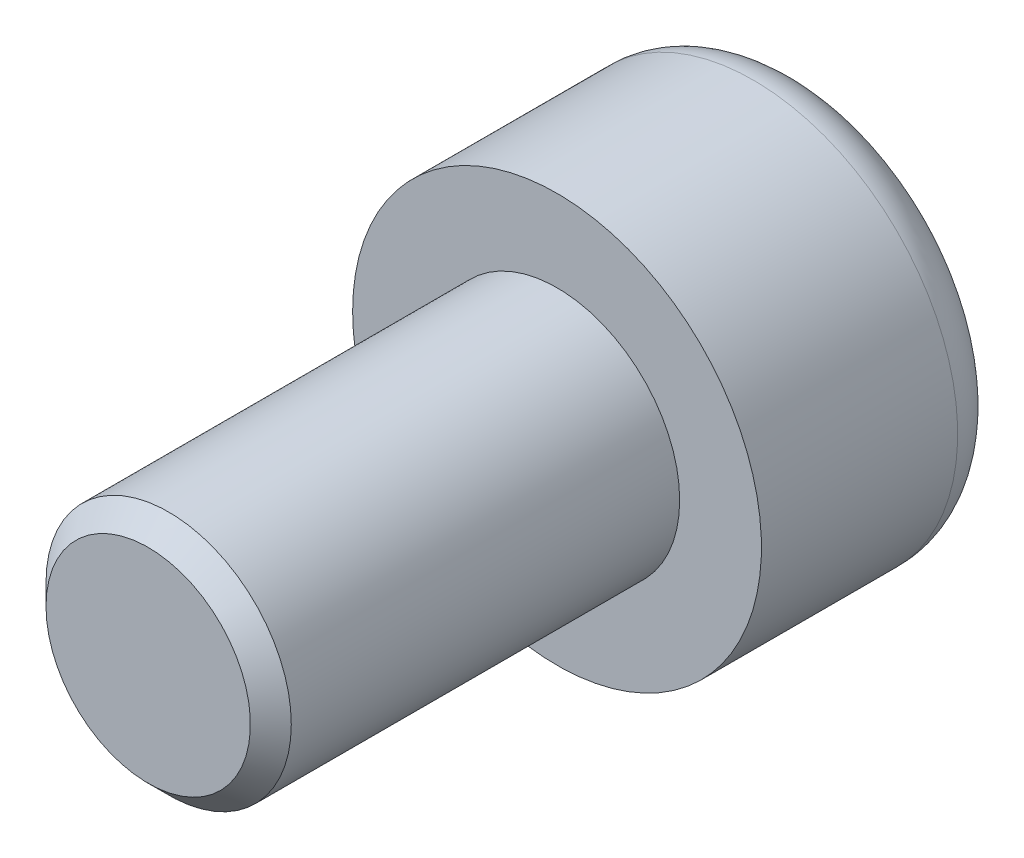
ISO-10303-21;
HEADER;
FILE_DESCRIPTION(('STEP AP214'),'2;1');
FILE_NAME('part.step','',(''),(''),'','','');
FILE_SCHEMA(('AUTOMOTIVE_DESIGN { 1 0 10303 214 1 1 1 1 }'));
ENDSEC;
DATA;
#1=APPLICATION_CONTEXT('core data for automotive mechanical design processes');
#2=APPLICATION_PROTOCOL_DEFINITION('international standard','automotive_design',2000,#1);
#3=PRODUCT_CONTEXT('',#1,'mechanical');
#4=PRODUCT('Part','Part','',(#3));
#5=PRODUCT_RELATED_PRODUCT_CATEGORY('part','',(#4));
#6=PRODUCT_DEFINITION_FORMATION('','',#4);
#7=PRODUCT_DEFINITION_CONTEXT('part definition',#1,'design');
#8=PRODUCT_DEFINITION('design','',#6,#7);
#9=PRODUCT_DEFINITION_SHAPE('','',#8);
#10=(LENGTH_UNIT() NAMED_UNIT(*) SI_UNIT(.MILLI.,.METRE.));
#11=(NAMED_UNIT(*) PLANE_ANGLE_UNIT() SI_UNIT($,.RADIAN.));
#12=(NAMED_UNIT(*) SI_UNIT($,.STERADIAN.) SOLID_ANGLE_UNIT());
#13=UNCERTAINTY_MEASURE_WITH_UNIT(LENGTH_MEASURE(1.E-05),#10,'distance_accuracy_value','');
#14=(GEOMETRIC_REPRESENTATION_CONTEXT(3) GLOBAL_UNCERTAINTY_ASSIGNED_CONTEXT((#13)) GLOBAL_UNIT_ASSIGNED_CONTEXT((#10,
#11,#12)) REPRESENTATION_CONTEXT('',''));
#15=CARTESIAN_POINT('',(0.,0.,0.));
#16=DIRECTION('',(0.,0.,1.));
#17=DIRECTION('',(1.,0.,0.));
#18=AXIS2_PLACEMENT_3D('',#15,#16,#17);
#19=CARTESIAN_POINT('',(-4.99999999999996,0.,3.75));
#20=DIRECTION('',(0.,0.,1.));
#21=DIRECTION('',(1.,0.,0.));
#22=AXIS2_PLACEMENT_3D('',#19,#20,#21);
#23=PLANE('',#22);
#24=DIRECTION('',(-0.866025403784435,0.500000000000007,0.));
#25=VECTOR('',#24,1.);
#26=CARTESIAN_POINT('',(0.,2.88675134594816,3.75));
#27=LINE('',#26,#25);
#28=CARTESIAN_POINT('',(0.,2.88675134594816,3.75));
#29=VERTEX_POINT('',#28);
#30=CARTESIAN_POINT('',(2.5,1.44337567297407,3.75));
#31=VERTEX_POINT('',#30);
#32=EDGE_CURVE('E64',#29,#31,#27,.F.);
#33=ORIENTED_EDGE('',*,*,#32,.T.);
#34=DIRECTION('',(0.,1.,0.));
#35=VECTOR('',#34,1.);
#36=CARTESIAN_POINT('',(2.5,1.44337567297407,3.75));
#37=LINE('',#36,#35);
#38=CARTESIAN_POINT('',(2.5,-1.44337567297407,3.75));
#39=VERTEX_POINT('',#38);
#40=EDGE_CURVE('E61',#31,#39,#37,.F.);
#41=ORIENTED_EDGE('',*,*,#40,.T.);
#42=DIRECTION('',(0.866025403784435,0.500000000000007,0.));
#43=VECTOR('',#42,1.);
#44=CARTESIAN_POINT('',(2.5,-1.44337567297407,3.75));
#45=LINE('',#44,#43);
#46=CARTESIAN_POINT('',(0.,-2.88675134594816,3.75));
#47=VERTEX_POINT('',#46);
#48=EDGE_CURVE('E58',#39,#47,#45,.F.);
#49=ORIENTED_EDGE('',*,*,#48,.T.);
#50=DIRECTION('',(0.866025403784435,-0.500000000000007,0.));
#51=VECTOR('',#50,1.);
#52=CARTESIAN_POINT('',(-2.5,-1.44337567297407,3.75));
#53=LINE('',#52,#51);
#54=CARTESIAN_POINT('',(-2.5,-1.44337567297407,3.75));
#55=VERTEX_POINT('',#54);
#56=EDGE_CURVE('E85',#47,#55,#53,.F.);
#57=ORIENTED_EDGE('',*,*,#56,.T.);
#58=DIRECTION('',(0.,1.,0.));
#59=VECTOR('',#58,1.);
#60=CARTESIAN_POINT('',(-2.5,1.44337567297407,3.75));
#61=LINE('',#60,#59);
#62=CARTESIAN_POINT('',(-2.5,1.44337567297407,3.75));
#63=VERTEX_POINT('',#62);
#64=EDGE_CURVE('E283',#55,#63,#61,.T.);
#65=ORIENTED_EDGE('',*,*,#64,.T.);
#66=DIRECTION('',(-0.866025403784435,-0.500000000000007,0.));
#67=VECTOR('',#66,1.);
#68=CARTESIAN_POINT('',(0.,2.88675134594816,3.75));
#69=LINE('',#68,#67);
#70=EDGE_CURVE('E290',#63,#29,#69,.F.);
#71=ORIENTED_EDGE('',*,*,#70,.T.);
#72=EDGE_LOOP('',(#33,#41,#49,#57,#65,#71));
#73=FACE_BOUND('',#72,.T.);
#74=ADVANCED_FACE('F15',(#73),#23,.F.);
#75=CARTESIAN_POINT('',(2.5,1.44337567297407,3.75));
#76=DIRECTION('',(1.,0.,0.));
#77=DIRECTION('',(0.,0.,-1.));
#78=AXIS2_PLACEMENT_3D('',#75,#76,#77);
#79=PLANE('',#78);
#80=DIRECTION('',(0.,0.,1.));
#81=VECTOR('',#80,1.);
#82=CARTESIAN_POINT('',(2.5,-1.44337567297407,3.75));
#83=LINE('',#82,#81);
#84=CARTESIAN_POINT('',(2.5,-1.44337567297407,0.));
#85=VERTEX_POINT('',#84);
#86=EDGE_CURVE('E68',#85,#39,#83,.T.);
#87=ORIENTED_EDGE('',*,*,#86,.T.);
#88=ORIENTED_EDGE('',*,*,#40,.F.);
#89=DIRECTION('',(0.,0.,1.));
#90=VECTOR('',#89,1.);
#91=CARTESIAN_POINT('',(2.5,1.44337567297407,3.75));
#92=LINE('',#91,#90);
#93=CARTESIAN_POINT('',(2.5,1.44337567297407,0.));
#94=VERTEX_POINT('',#93);
#95=EDGE_CURVE('E121',#31,#94,#92,.F.);
#96=ORIENTED_EDGE('',*,*,#95,.T.);
#97=DIRECTION('',(0.,1.,0.));
#98=VECTOR('',#97,1.);
#99=CARTESIAN_POINT('',(2.5,0.,0.));
#100=LINE('',#99,#98);
#101=EDGE_CURVE('E75',#94,#85,#100,.F.);
#102=ORIENTED_EDGE('',*,*,#101,.T.);
#103=EDGE_LOOP('',(#87,#88,#96,#102));
#104=FACE_BOUND('',#103,.T.);
#105=ADVANCED_FACE('F72',(#104),#79,.F.);
#106=CARTESIAN_POINT('',(2.5,-1.44337567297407,3.75));
#107=DIRECTION('',(0.500000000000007,-0.866025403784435,0.));
#108=DIRECTION('',(0.866025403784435,0.500000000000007,0.));
#109=AXIS2_PLACEMENT_3D('',#106,#107,#108);
#110=PLANE('',#109);
#111=DIRECTION('',(0.,0.,1.));
#112=VECTOR('',#111,1.);
#113=CARTESIAN_POINT('',(0.,-2.88675134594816,3.75));
#114=LINE('',#113,#112);
#115=CARTESIAN_POINT('',(0.,-2.88675134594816,0.));
#116=VERTEX_POINT('',#115);
#117=EDGE_CURVE('E82',#116,#47,#114,.T.);
#118=ORIENTED_EDGE('',*,*,#117,.T.);
#119=ORIENTED_EDGE('',*,*,#48,.F.);
#120=ORIENTED_EDGE('',*,*,#86,.F.);
#121=DIRECTION('',(-0.866025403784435,-0.500000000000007,0.));
#122=VECTOR('',#121,1.);
#123=CARTESIAN_POINT('',(2.5,-1.44337567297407,0.));
#124=LINE('',#123,#122);
#125=EDGE_CURVE('E119',#85,#116,#124,.T.);
#126=ORIENTED_EDGE('',*,*,#125,.T.);
#127=EDGE_LOOP('',(#118,#119,#120,#126));
#128=FACE_BOUND('',#127,.T.);
#129=ADVANCED_FACE('F80',(#128),#110,.F.);
#130=CARTESIAN_POINT('',(-2.5,-1.44337567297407,3.75));
#131=DIRECTION('',(-0.500000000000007,-0.866025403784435,0.));
#132=DIRECTION('',(0.866025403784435,-0.500000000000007,0.));
#133=AXIS2_PLACEMENT_3D('',#130,#131,#132);
#134=PLANE('',#133);
#135=DIRECTION('',(0.,0.,1.));
#136=VECTOR('',#135,1.);
#137=CARTESIAN_POINT('',(-2.5,-1.44337567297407,3.75));
#138=LINE('',#137,#136);
#139=CARTESIAN_POINT('',(-2.5,-1.44337567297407,0.));
#140=VERTEX_POINT('',#139);
#141=EDGE_CURVE('E278',#140,#55,#138,.T.);
#142=ORIENTED_EDGE('',*,*,#141,.T.);
#143=ORIENTED_EDGE('',*,*,#56,.F.);
#144=ORIENTED_EDGE('',*,*,#117,.F.);
#145=DIRECTION('',(-0.866025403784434,0.500000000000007,0.));
#146=VECTOR('',#145,1.);
#147=CARTESIAN_POINT('',(0.,-2.88675134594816,0.));
#148=LINE('',#147,#146);
#149=EDGE_CURVE('E116',#116,#140,#148,.T.);
#150=ORIENTED_EDGE('',*,*,#149,.T.);
#151=EDGE_LOOP('',(#142,#143,#144,#150));
#152=FACE_BOUND('',#151,.T.);
#153=ADVANCED_FACE('F233',(#152),#134,.F.);
#154=CARTESIAN_POINT('',(-2.5,1.44337567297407,3.75));
#155=DIRECTION('',(-1.,0.,0.));
#156=DIRECTION('',(0.,0.,1.));
#157=AXIS2_PLACEMENT_3D('',#154,#155,#156);
#158=PLANE('',#157);
#159=DIRECTION('',(0.,0.,1.));
#160=VECTOR('',#159,1.);
#161=CARTESIAN_POINT('',(-2.5,1.44337567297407,3.75));
#162=LINE('',#161,#160);
#163=CARTESIAN_POINT('',(-2.5,1.44337567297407,0.));
#164=VERTEX_POINT('',#163);
#165=EDGE_CURVE('E287',#164,#63,#162,.T.);
#166=ORIENTED_EDGE('',*,*,#165,.T.);
#167=ORIENTED_EDGE('',*,*,#64,.F.);
#168=ORIENTED_EDGE('',*,*,#141,.F.);
#169=DIRECTION('',(0.,1.,0.));
#170=VECTOR('',#169,1.);
#171=CARTESIAN_POINT('',(-2.5,0.,0.));
#172=LINE('',#171,#170);
#173=EDGE_CURVE('E107',#140,#164,#172,.T.);
#174=ORIENTED_EDGE('',*,*,#173,.T.);
#175=EDGE_LOOP('',(#166,#167,#168,#174));
#176=FACE_BOUND('',#175,.T.);
#177=ADVANCED_FACE('F223',(#176),#158,.F.);
#178=CARTESIAN_POINT('',(0.,2.88675134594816,3.75));
#179=DIRECTION('',(-0.500000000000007,0.866025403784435,0.));
#180=DIRECTION('',(-0.866025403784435,-0.500000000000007,0.));
#181=AXIS2_PLACEMENT_3D('',#178,#179,#180);
#182=PLANE('',#181);
#183=DIRECTION('',(0.,0.,1.));
#184=VECTOR('',#183,1.);
#185=CARTESIAN_POINT('',(0.,2.88675134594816,3.75));
#186=LINE('',#185,#184);
#187=CARTESIAN_POINT('',(0.,2.88675134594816,0.));
#188=VERTEX_POINT('',#187);
#189=EDGE_CURVE('E294',#188,#29,#186,.T.);
#190=ORIENTED_EDGE('',*,*,#189,.T.);
#191=ORIENTED_EDGE('',*,*,#70,.F.);
#192=ORIENTED_EDGE('',*,*,#165,.F.);
#193=DIRECTION('',(0.866025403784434,0.500000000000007,0.));
#194=VECTOR('',#193,1.);
#195=CARTESIAN_POINT('',(-2.5,1.44337567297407,0.));
#196=LINE('',#195,#194);
#197=EDGE_CURVE('E101',#164,#188,#196,.T.);
#198=ORIENTED_EDGE('',*,*,#197,.T.);
#199=EDGE_LOOP('',(#190,#191,#192,#198));
#200=FACE_BOUND('',#199,.T.);
#201=ADVANCED_FACE('F162',(#200),#182,.F.);
#202=CARTESIAN_POINT('',(0.,2.88675134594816,3.75));
#203=DIRECTION('',(0.500000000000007,0.866025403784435,0.));
#204=DIRECTION('',(-0.866025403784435,0.500000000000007,0.));
#205=AXIS2_PLACEMENT_3D('',#202,#203,#204);
#206=PLANE('',#205);
#207=ORIENTED_EDGE('',*,*,#95,.F.);
#208=ORIENTED_EDGE('',*,*,#32,.F.);
#209=ORIENTED_EDGE('',*,*,#189,.F.);
#210=DIRECTION('',(0.866025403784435,-0.500000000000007,0.));
#211=VECTOR('',#210,1.);
#212=CARTESIAN_POINT('',(0.,2.88675134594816,0.));
#213=LINE('',#212,#211);
#214=EDGE_CURVE('E99',#188,#94,#213,.T.);
#215=ORIENTED_EDGE('',*,*,#214,.T.);
#216=EDGE_LOOP('',(#207,#208,#209,#215));
#217=FACE_BOUND('',#216,.T.);
#218=ADVANCED_FACE('F156',(#217),#206,.F.);
#219=CARTESIAN_POINT('',(0.,0.,0.));
#220=DIRECTION('',(0.,0.,1.));
#221=DIRECTION('',(1.,0.,0.));
#222=AXIS2_PLACEMENT_3D('',#219,#220,#221);
#223=PLANE('',#222);
#224=ORIENTED_EDGE('',*,*,#197,.F.);
#225=ORIENTED_EDGE('',*,*,#173,.F.);
#226=ORIENTED_EDGE('',*,*,#149,.F.);
#227=ORIENTED_EDGE('',*,*,#125,.F.);
#228=ORIENTED_EDGE('',*,*,#101,.F.);
#229=ORIENTED_EDGE('',*,*,#214,.F.);
#230=EDGE_LOOP('',(#224,#225,#226,#227,#228,#229));
#231=FACE_BOUND('',#230,.T.);
#232=CARTESIAN_POINT('',(0.,0.,0.));
#233=DIRECTION('',(0.,0.,1.));
#234=DIRECTION('',(1.,0.,0.));
#235=AXIS2_PLACEMENT_3D('',#232,#233,#234);
#236=CIRCLE('',#235,3.8);
#237=CARTESIAN_POINT('',(3.8,0.,0.));
#238=VERTEX_POINT('',#237);
#239=CARTESIAN_POINT('',(-3.8,0.,0.));
#240=VERTEX_POINT('',#239);
#241=EDGE_CURVE('E97',#238,#240,#236,.T.);
#242=ORIENTED_EDGE('',*,*,#241,.F.);
#243=CARTESIAN_POINT('',(0.,0.,0.));
#244=DIRECTION('',(0.,0.,1.));
#245=DIRECTION('',(-1.,0.,0.));
#246=AXIS2_PLACEMENT_3D('',#243,#244,#245);
#247=CIRCLE('',#246,3.8);
#248=EDGE_CURVE('E34',#240,#238,#247,.T.);
#249=ORIENTED_EDGE('',*,*,#248,.F.);
#250=EDGE_LOOP('',(#242,#249));
#251=FACE_BOUND('',#250,.T.);
#252=ADVANCED_FACE('F137',(#231,#251),#223,.F.);
#253=CARTESIAN_POINT('',(0.,0.,1.2));
#254=DIRECTION('',(0.,0.,1.));
#255=DIRECTION('',(1.,0.,0.));
#256=AXIS2_PLACEMENT_3D('',#253,#254,#255);
#257=TOROIDAL_SURFACE('',#256,3.8,1.2);
#258=CARTESIAN_POINT('',(0.,0.,1.2));
#259=DIRECTION('',(0.,0.,-1.));
#260=DIRECTION('',(-1.,0.,0.));
#261=AXIS2_PLACEMENT_3D('',#258,#259,#260);
#262=CIRCLE('',#261,5.);
#263=CARTESIAN_POINT('',(-5.,0.,1.2));
#264=VERTEX_POINT('',#263);
#265=EDGE_CURVE('E94',#264,#264,#262,.F.);
#266=ORIENTED_EDGE('',*,*,#265,.F.);
#267=EDGE_LOOP('',(#266));
#268=FACE_BOUND('',#267,.T.);
#269=ORIENTED_EDGE('',*,*,#241,.T.);
#270=ORIENTED_EDGE('',*,*,#248,.T.);
#271=EDGE_LOOP('',(#269,#270));
#272=FACE_BOUND('',#271,.T.);
#273=ADVANCED_FACE('F96',(#268,#272),#257,.T.);
#274=CARTESIAN_POINT('',(0.,0.,16.));
#275=DIRECTION('',(0.,0.,1.));
#276=DIRECTION('',(1.,0.,0.));
#277=AXIS2_PLACEMENT_3D('',#274,#275,#276);
#278=PLANE('',#277);
#279=CARTESIAN_POINT('',(0.,0.,15.9999999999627));
#280=DIRECTION('',(0.,0.,-1.));
#281=DIRECTION('',(-1.,0.,0.));
#282=AXIS2_PLACEMENT_3D('',#279,#280,#281);
#283=CIRCLE('',#282,2.49999999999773);
#284=CARTESIAN_POINT('',(-2.49999999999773,0.,15.9999999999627));
#285=VERTEX_POINT('',#284);
#286=EDGE_CURVE('E92',#285,#285,#283,.T.);
#287=ORIENTED_EDGE('',*,*,#286,.F.);
#288=EDGE_LOOP('',(#287));
#289=FACE_BOUND('',#288,.T.);
#290=ADVANCED_FACE('F136',(#289),#278,.T.);
#291=CARTESIAN_POINT('',(0.,0.,6.));
#292=DIRECTION('',(0.,0.,-1.));
#293=DIRECTION('',(-1.,0.,0.));
#294=AXIS2_PLACEMENT_3D('',#291,#292,#293);
#295=CYLINDRICAL_SURFACE('',#294,5.);
#296=ORIENTED_EDGE('',*,*,#265,.T.);
#297=EDGE_LOOP('',(#296));
#298=FACE_BOUND('',#297,.T.);
#299=CARTESIAN_POINT('',(0.,0.,6.));
#300=DIRECTION('',(0.,0.,-1.));
#301=DIRECTION('',(-1.,0.,0.));
#302=AXIS2_PLACEMENT_3D('',#299,#300,#301);
#303=CIRCLE('',#302,5.);
#304=CARTESIAN_POINT('',(-5.,0.,6.));
#305=VERTEX_POINT('',#304);
#306=EDGE_CURVE('E89',#305,#305,#303,.F.);
#307=ORIENTED_EDGE('',*,*,#306,.F.);
#308=EDGE_LOOP('',(#307));
#309=FACE_BOUND('',#308,.T.);
#310=ADVANCED_FACE('F178',(#298,#309),#295,.T.);
#311=CARTESIAN_POINT('',(0.,0.,15.4999999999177));
#312=DIRECTION('',(0.,0.,-1.));
#313=DIRECTION('',(-1.,0.,0.));
#314=AXIS2_PLACEMENT_3D('',#311,#312,#313);
#315=CONICAL_SURFACE('',#314,2.9999999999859,0.785398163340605);
#316=CARTESIAN_POINT('',(0.,0.,15.5));
#317=DIRECTION('',(0.,0.,-1.));
#318=DIRECTION('',(-1.,0.,0.));
#319=AXIS2_PLACEMENT_3D('',#316,#317,#318);
#320=CIRCLE('',#319,3.);
#321=CARTESIAN_POINT('',(-3.,0.,15.5));
#322=VERTEX_POINT('',#321);
#323=EDGE_CURVE('E26',#322,#322,#320,.T.);
#324=ORIENTED_EDGE('',*,*,#323,.F.);
#325=EDGE_LOOP('',(#324));
#326=FACE_BOUND('',#325,.T.);
#327=ORIENTED_EDGE('',*,*,#286,.T.);
#328=EDGE_LOOP('',(#327));
#329=FACE_BOUND('',#328,.T.);
#330=ADVANCED_FACE('F172',(#326,#329),#315,.T.);
#331=CARTESIAN_POINT('',(0.,0.,6.));
#332=DIRECTION('',(0.,0.,1.));
#333=DIRECTION('',(1.,0.,0.));
#334=AXIS2_PLACEMENT_3D('',#331,#332,#333);
#335=PLANE('',#334);
#336=CARTESIAN_POINT('',(0.,0.,6.));
#337=DIRECTION('',(0.,0.,-1.));
#338=DIRECTION('',(-1.,0.,0.));
#339=AXIS2_PLACEMENT_3D('',#336,#337,#338);
#340=CIRCLE('',#339,3.);
#341=CARTESIAN_POINT('',(-3.,0.,6.));
#342=VERTEX_POINT('',#341);
#343=EDGE_CURVE('E10',#342,#342,#340,.F.);
#344=ORIENTED_EDGE('',*,*,#343,.F.);
#345=EDGE_LOOP('',(#344));
#346=FACE_BOUND('',#345,.T.);
#347=ORIENTED_EDGE('',*,*,#306,.T.);
#348=EDGE_LOOP('',(#347));
#349=FACE_BOUND('',#348,.T.);
#350=ADVANCED_FACE('F166',(#346,#349),#335,.T.);
#351=CARTESIAN_POINT('',(0.,0.,16.));
#352=DIRECTION('',(0.,0.,-1.));
#353=DIRECTION('',(-1.,0.,0.));
#354=AXIS2_PLACEMENT_3D('',#351,#352,#353);
#355=CYLINDRICAL_SURFACE('',#354,3.);
#356=ORIENTED_EDGE('',*,*,#343,.T.);
#357=EDGE_LOOP('',(#356));
#358=FACE_BOUND('',#357,.T.);
#359=ORIENTED_EDGE('',*,*,#323,.T.);
#360=EDGE_LOOP('',(#359));
#361=FACE_BOUND('',#360,.T.);
#362=ADVANCED_FACE('F164',(#358,#361),#355,.T.);
#363=CLOSED_SHELL('',(#74,#105,#129,#153,#177,#201,#218,#252,#273,#290,#310,#330,#350,#362));
#364=MANIFOLD_SOLID_BREP('B1',#363);
#365=ADVANCED_BREP_SHAPE_REPRESENTATION('',(#18,#364),#14);
#366=SHAPE_DEFINITION_REPRESENTATION(#9,#365);
ENDSEC;
END-ISO-10303-21;
